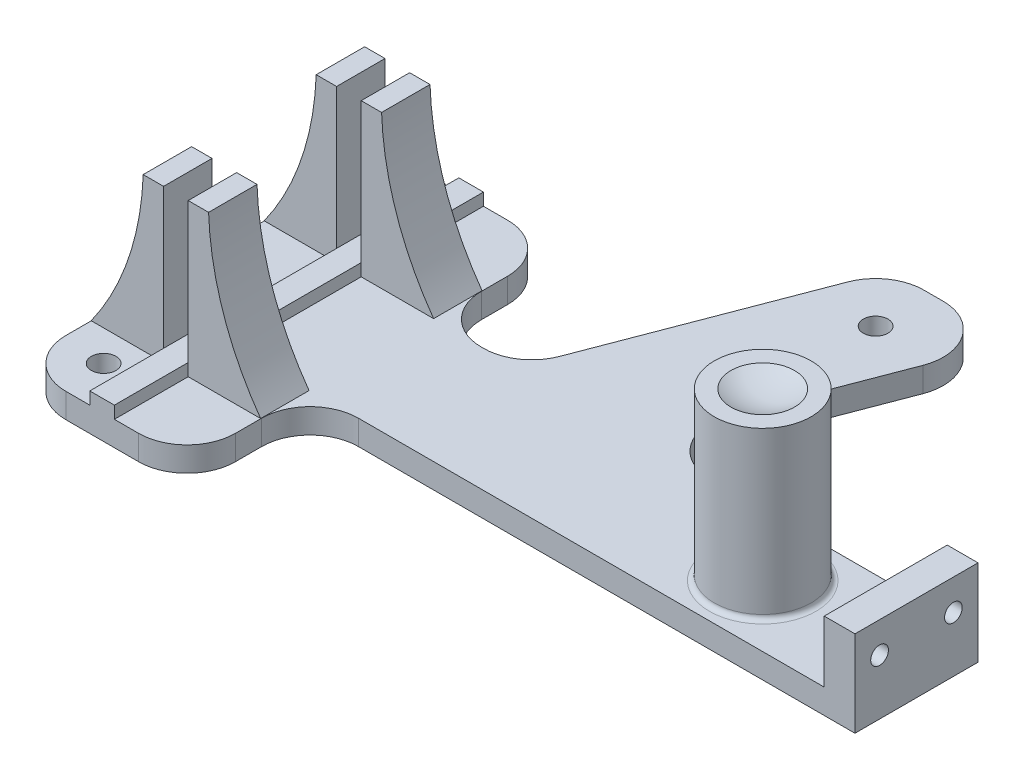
from build123d import *

# Parameters (mm, degrees)
BOSS_EXTRUDE1_DEPTH       = 5.08
BOSS_EXTRUDE2_DEPTH       = 10
SKETCH3_R                 = 10
BOSS_EXTRUDE3_DEPTH       = 34.29
FILLET1_R                 = 1
BOSS_EXTRUDE5_DEPTH       = 5.08
FILLET2_R                 = 10
FILLET3_R                 = 10
SKETCH9_W                 = 6.35
SKETCH9_H                 = 25.4
BOSS_EXTRUDE6_DEPTH       = 12.7
F_6_CLEARANCE_HOLE1_D     = 3.6576
F_6_CLEARANCE_HOLE1_DEPTH = 6.35
CUT_EXTRUDE1_REACH        = 156.38
SKETCH17_R                = 2.54
SKETCH18_W                = 5.08
SKETCH18_H                = 76.2
BOSS_EXTRUDE7_DEPTH       = 2.54


with BuildPart() as part:
    # Sketch1 → Boss-Extrude1 (new body)
    with BuildSketch(Plane(origin=(0, 0, 0), x_dir=(1, 0, 0), z_dir=(0, 1, 0))):
        with BuildLine():
            Line((20.08, 28.1), (20.08, 22.7))
            ThreePointArc((20.08, 22.7), (23.008932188, 15.628932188), (30.08, 12.7))
            Line((30.08, 12.7), (126.24, 12.7))
            Line((126.24, 12.7), (132.59, 12.7))
            Line((132.59, 12.7), (132.59, 0))
            Line((132.59, 0), (132.59, -12.7))
            Line((132.59, -12.7), (126.24, -12.7))
            Line((126.24, -12.7), (30.08, -12.7))
            ThreePointArc((30.08, -12.7), (23.008932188, -15.628932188), (20.08, -22.7))
            Line((20.08, -22.7), (20.08, -28.1))
            ThreePointArc((20.08, -28.1), (17.151067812, -35.171067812), (10.08, -38.1))
            Line((10.08, -38.1), (-4.92, -38.1))
            ThreePointArc((-4.92, -38.1), (-11.991067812, -35.171067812), (-14.92, -28.1))
            Line((-14.92, -28.1), (-14.92, 28.1))
            ThreePointArc((-14.92, 28.1), (-11.991067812, 35.171067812), (-4.92, 38.1))
            Line((-4.92, 38.1), (10.08, 38.1))
            ThreePointArc((10.08, 38.1), (17.151067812, 35.171067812), (20.08, 28.1))
        make_face()
    extrude(amount=-BOSS_EXTRUDE1_DEPTH)

    # Sketch2 → Boss-Extrude2 (add)
    with BuildSketch(Plane.XY.offset(22.86)):
        with BuildLine():
            Line((0, 0), (-14.953299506, 0))
            ThreePointArc((-14.953299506, 0), (-7.255141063, 14.95657571), (-4.209502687, 31.5))
            Line((-4.209502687, 31.5), (0, 31.5))
            Line((0, 31.5), (0, 0))
        make_face()
        with BuildLine():
            Line((5.08, 0), (20.033299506, 0))
            ThreePointArc((20.033299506, 0), (12.335141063, 14.95657571), (9.289502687, 31.5))
            Line((9.289502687, 31.5), (5.08, 31.5))
            Line((5.08, 31.5), (5.08, 0))
        make_face()
    boss_extrude2 = extrude(amount=-BOSS_EXTRUDE2_DEPTH)

    # Mirror1: Boss-Extrude2 across plane
    add(boss_extrude2.mirror(Plane.XY))

    # Sketch3 → Boss-Extrude3 (add)
    with BuildSketch(Plane(origin=(0, 0, 0), x_dir=(1, 0, 0), z_dir=(0, 1, 0))):
        with Locations(Location((100.84, 0, 0), (0, 0, 270))):
            Circle(SKETCH3_R)
    extrude(amount=BOSS_EXTRUDE3_DEPTH)

    # Fillet1
    fillet1_edges = [part.edges().sort_by_distance(p)[0] for p in [
        (100.84, 0, -10),
    ]]
    fillet(fillet1_edges, radius=FILLET1_R)

    # Sketch4 → Cut-Revolve1 (revolve, cut)
    with BuildSketch(Plane.XY):
        with BuildLine():
            Line((100.84, 34.29), (107.399510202, 34.29))
            ThreePointArc((107.399510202, 34.29), (104.216336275, 33.092422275), (100.84, 32.683592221))
            Line((100.84, 32.683592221), (100.84, 34.29))
        make_face()
    revolve(axis=Axis((100.84, 34.29, 0), (0, -1, 0)), mode=Mode.SUBTRACT)

    # Sketch8 → Boss-Extrude5 (add)
    with BuildSketch(Plane(origin=(0, 0, 0), x_dir=(1, 0, 0), z_dir=(0, 1, 0))):
        with BuildLine():
            Line((37.34, 12.7), (56.207184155, 62.145063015))
            ThreePointArc((56.207184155, 62.145063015), (59.87783999, 66.815612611), (65.550113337, 68.58))
            Line((65.550113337, 68.58), (69.543550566, 68.58))
            ThreePointArc((69.543550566, 68.58), (77.779163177, 64.252273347), (78.886479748, 55.014936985))
            Line((78.886479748, 55.014936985), (62.74, 12.7))
            Line((62.74, 12.7), (37.34, 12.7))
        make_face()
    extrude(amount=-BOSS_EXTRUDE5_DEPTH)

    # Fillet2
    fillet2_edges = [part.edges().sort_by_distance(p)[0] for p in [
        (37.34, -2.54, -12.7),
    ]]
    fillet(fillet2_edges, radius=FILLET2_R)

    # Fillet3
    fillet3_edges = [part.edges().sort_by_distance(p)[0] for p in [
        (62.74, -2.54, -12.7),
    ]]
    fillet(fillet3_edges, radius=FILLET3_R)

    # Sketch9 → Boss-Extrude6 (add)
    with BuildSketch(Plane(origin=(0, 0, 0), x_dir=(1, 0, 0), z_dir=(0, 1, 0))):
        with Locations((129.415, 0)):
            Rectangle(SKETCH9_W, SKETCH9_H)
    extrude(amount=BOSS_EXTRUDE6_DEPTH)

    # 6 Clearance Hole1
    with Locations(Plane(origin=(132.59, 0, 0), x_dir=(0, 0, -1), z_dir=(1, 0, 0))):
        with Locations((7.62, 6.35), (-7.62, 6.35)):
            Hole(F_6_CLEARANCE_HOLE1_D / 2, depth=F_6_CLEARANCE_HOLE1_DEPTH)

    # Sketch17 → Cut-Extrude1 (cut, up to next)
    with BuildSketch(Plane.XZ.offset(5.08), mode=Mode.PRIVATE) as cut_extrude1_sk1:
        with Locations(Location((-6.03, 29.21, 0), (0, 0, 270))):
            Circle(SKETCH17_R)
    cut_extrude1_tool1 = extrude(cut_extrude1_sk1.sketch, amount=-CUT_EXTRUDE1_REACH, mode=Mode.PRIVATE) & part.part
    # Sketch17 → Cut-Extrude1 (cut, up to next)
    with BuildSketch(Plane.XZ.offset(5.08), mode=Mode.PRIVATE) as cut_extrude1_sk2:
        with Locations(Location((-6.03, -29.21, 0), (0, 0, 90))):
            Circle(SKETCH17_R)
    cut_extrude1_tool2 = extrude(cut_extrude1_sk2.sketch, amount=-CUT_EXTRUDE1_REACH, mode=Mode.PRIVATE) & part.part
    # Sketch17 → Cut-Extrude1 (cut, up to next)
    with BuildSketch(Plane.XZ.offset(5.08), mode=Mode.PRIVATE) as cut_extrude1_sk3:
        with Locations(Location((67.001174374, -57.15, 0), (0, 0, 270))):
            Circle(SKETCH17_R)
    cut_extrude1_tool3 = extrude(cut_extrude1_sk3.sketch, amount=-CUT_EXTRUDE1_REACH, mode=Mode.PRIVATE) & part.part
    # Sketch17 → Cut-Extrude1 (cut, up to next)
    with BuildSketch(Plane.XZ.offset(5.08), mode=Mode.PRIVATE) as cut_extrude1_sk4:
        with Locations(Location((118.62, 0, 0), (0, 0, 270))):
            Circle(SKETCH17_R)
    cut_extrude1_tool4 = extrude(cut_extrude1_sk4.sketch, amount=-CUT_EXTRUDE1_REACH, mode=Mode.PRIVATE) & part.part
    add(cut_extrude1_tool1.solids().sort_by_distance((-6.03, -5.08, 29.21))[0], mode=Mode.SUBTRACT)
    add(cut_extrude1_tool2.solids().sort_by_distance((-6.03, -5.08, -29.21))[0], mode=Mode.SUBTRACT)
    add(cut_extrude1_tool3.solids().sort_by_distance((67.001174, -5.08, -57.15))[0], mode=Mode.SUBTRACT)
    add(cut_extrude1_tool4.solids().sort_by_distance((118.62, -5.08, 0))[0], mode=Mode.SUBTRACT)

    # Sketch18 → Boss-Extrude7 (add)
    with BuildSketch(Plane(origin=(0, 0, 0), x_dir=(1, 0, 0), z_dir=(0, 1, 0))):
        with Locations((2.54, 0)):
            Rectangle(SKETCH18_W, SKETCH18_H)
    extrude(amount=BOSS_EXTRUDE7_DEPTH)


solid = part.part
